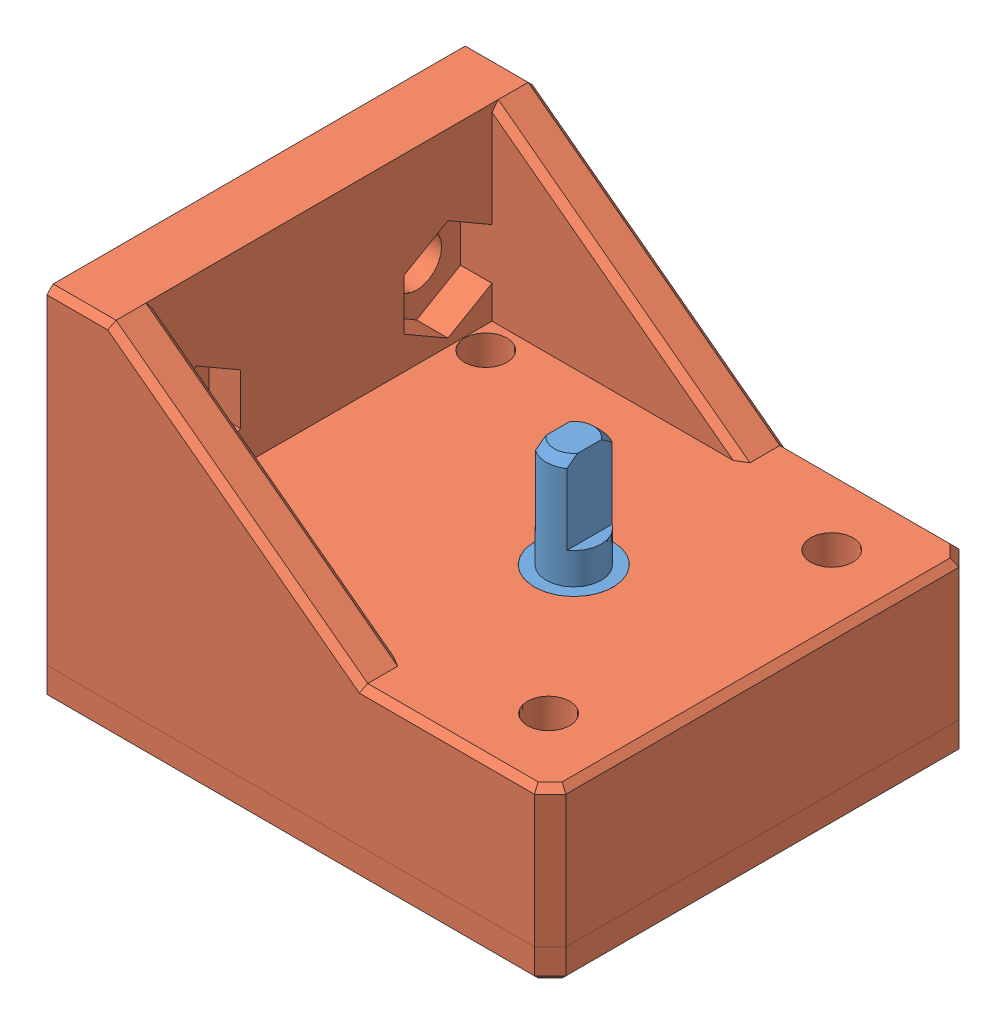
SolidWorks assembly Potenciometr HS-322.SLDASM, configuration Výchozí (file format 7000). Lengths in mm.
Overall size (32 22.8 27).
3 component instances, 2 part files, 6 mates.
Components (placement in the parent):
- Potenciometr HS-322-1: Potenciometr HS-322.SLDPRT [Výchozí] at (-18.995 -16.8479 13.4806) size (16 15.5 10)
- Drzak potenciometru HS-322-1: Drzak potenciometru HS-322.SLDPRT [Skříň] at (-18.995 -13.8479 13.4806) x (0 0 1) z (0 1 0) size (27 32 20.8)
- Drzak potenciometru HS-322-2: Drzak potenciometru HS-322.SLDPRT [Víko] at (-18.995 -13.8479 13.4806) x (0 0 1) z (0 1 0) size (27 32 2)
Mates (geometry in assembly coordinates):
- Soustředná73: concentric anti-aligned: cylinder of Drzak potenciometru HS-322-1 through (-12.8205 -42.0307 31.6391) axis (0 1 0) radius 1.35; circle of Drzak potenciometru HS-322-2
- Soustředná74: concentric anti-aligned: cylinder of Drzak potenciometru HS-322-1 through (-34.8205 -42.0307 13.6391) axis (0 1 0) radius 1.35; circle of Drzak potenciometru HS-322-2
- Sjednocená85: coincident anti-aligned: plane of Drzak potenciometru HS-322-1 through (-20.2205 -40.0297 22.6391) normal (0 -1 0); plane of Drzak potenciometru HS-322-2 through (-20.2205 -40.0297 22.6391) normal (0 1 0)
- Soustředná75: concentric: cylinder of Potenciometr HS-322-1 through (-18.995 -13.8479 13.4806) axis (0 -1 0) radius 2.5; cylinder of Drzak potenciometru HS-322-1 through (-18.995 -17.8479 13.4806) axis (0 1 0) radius 2.5
- Sjednocená86: coincident: plane of Potenciometr HS-322-1 through (-18.995 -16.8479 13.4806) normal (0 1 0); plane of Drzak potenciometru HS-322-1 through (-18.995 -16.8479 13.4806) normal (0 -1 0)
- Sjednocená87: coincident anti-aligned: plane of Potenciometr HS-322-1 through (-24.995 -22.3479 8.4806) normal (0 0 -1); plane of Drzak potenciometru HS-322-1 through (-29.995 -16.8479 8.4806) normal (0 0 1)
